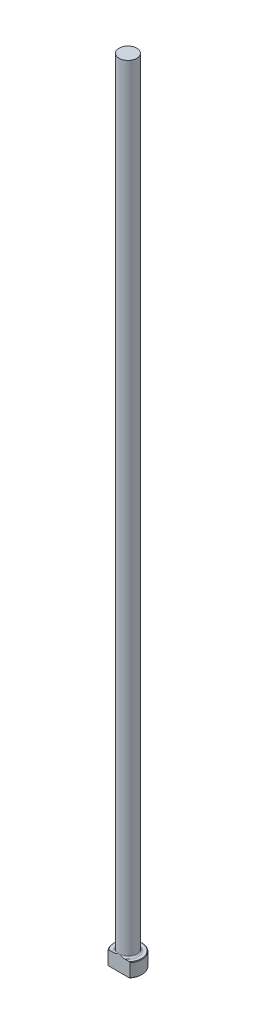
ISO-10303-21;
HEADER;
FILE_DESCRIPTION(('STEP AP214'),'2;1');
FILE_NAME('part.step','',(''),(''),'','','');
FILE_SCHEMA(('AUTOMOTIVE_DESIGN { 1 0 10303 214 1 1 1 1 }'));
ENDSEC;
DATA;
#1=APPLICATION_CONTEXT('core data for automotive mechanical design processes');
#2=APPLICATION_PROTOCOL_DEFINITION('international standard','automotive_design',2000,#1);
#3=PRODUCT_CONTEXT('',#1,'mechanical');
#4=PRODUCT('Part','Part','',(#3));
#5=PRODUCT_RELATED_PRODUCT_CATEGORY('part','',(#4));
#6=PRODUCT_DEFINITION_FORMATION('','',#4);
#7=PRODUCT_DEFINITION_CONTEXT('part definition',#1,'design');
#8=PRODUCT_DEFINITION('design','',#6,#7);
#9=PRODUCT_DEFINITION_SHAPE('','',#8);
#10=(LENGTH_UNIT() NAMED_UNIT(*) SI_UNIT(.MILLI.,.METRE.));
#11=(NAMED_UNIT(*) PLANE_ANGLE_UNIT() SI_UNIT($,.RADIAN.));
#12=(NAMED_UNIT(*) SI_UNIT($,.STERADIAN.) SOLID_ANGLE_UNIT());
#13=UNCERTAINTY_MEASURE_WITH_UNIT(LENGTH_MEASURE(1.E-05),#10,'distance_accuracy_value','');
#14=(GEOMETRIC_REPRESENTATION_CONTEXT(3) GLOBAL_UNCERTAINTY_ASSIGNED_CONTEXT((#13)) GLOBAL_UNIT_ASSIGNED_CONTEXT((#10,
#11,#12)) REPRESENTATION_CONTEXT('',''));
#15=CARTESIAN_POINT('',(0.,0.,0.));
#16=DIRECTION('',(0.,0.,1.));
#17=DIRECTION('',(1.,0.,0.));
#18=AXIS2_PLACEMENT_3D('',#15,#16,#17);
#19=CARTESIAN_POINT('',(0.,0.,0.));
#20=DIRECTION('',(0.,-1.,0.));
#21=DIRECTION('',(0.,0.,-1.));
#22=AXIS2_PLACEMENT_3D('',#19,#20,#21);
#23=PLANE('',#22);
#24=CARTESIAN_POINT('',(0.,0.,0.));
#25=DIRECTION('',(0.,-1.,0.));
#26=DIRECTION('',(0.,0.,-1.));
#27=AXIS2_PLACEMENT_3D('',#24,#25,#26);
#28=CIRCLE('',#27,6.09599999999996);
#29=CARTESIAN_POINT('',(-4.62711999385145,0.,3.96874999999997));
#30=VERTEX_POINT('',#29);
#31=CARTESIAN_POINT('',(4.62711999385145,0.,3.96874999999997));
#32=VERTEX_POINT('',#31);
#33=EDGE_CURVE('E98',#30,#32,#28,.T.);
#34=ORIENTED_EDGE('',*,*,#33,.T.);
#35=DIRECTION('',(-1.,0.,0.));
#36=VECTOR('',#35,1.);
#37=CARTESIAN_POINT('',(-4.95696716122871,0.,3.96874999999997));
#38=LINE('',#37,#36);
#39=EDGE_CURVE('E83',#32,#30,#38,.T.);
#40=ORIENTED_EDGE('',*,*,#39,.T.);
#41=EDGE_LOOP('',(#34,#40));
#42=FACE_BOUND('',#41,.T.);
#43=ADVANCED_FACE('F32',(#42),#23,.T.);
#44=CARTESIAN_POINT('',(0.,259.958771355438,0.));
#45=DIRECTION('',(0.,1.,0.));
#46=DIRECTION('',(0.,0.,1.));
#47=AXIS2_PLACEMENT_3D('',#44,#45,#46);
#48=CYLINDRICAL_SURFACE('',#47,6.34999999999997);
#49=CARTESIAN_POINT('',(0.,6.0960000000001,0.));
#50=DIRECTION('',(0.,1.,0.));
#51=DIRECTION('',(0.,0.,1.));
#52=AXIS2_PLACEMENT_3D('',#49,#50,#51);
#53=CIRCLE('',#52,6.34999999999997);
#54=CARTESIAN_POINT('',(-4.95696716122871,6.0960000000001,3.96874999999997));
#55=VERTEX_POINT('',#54);
#56=CARTESIAN_POINT('',(4.95696716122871,6.0960000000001,3.96874999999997));
#57=VERTEX_POINT('',#56);
#58=EDGE_CURVE('E104',#55,#57,#53,.F.);
#59=ORIENTED_EDGE('',*,*,#58,.T.);
#60=DIRECTION('',(0.,-1.,0.));
#61=VECTOR('',#60,1.);
#62=CARTESIAN_POINT('',(4.95696716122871,355.6,3.96874999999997));
#63=LINE('',#62,#61);
#64=CARTESIAN_POINT('',(4.95696716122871,0.254000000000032,3.96874999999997));
#65=VERTEX_POINT('',#64);
#66=EDGE_CURVE('E183',#57,#65,#63,.T.);
#67=ORIENTED_EDGE('',*,*,#66,.T.);
#68=CARTESIAN_POINT('',(0.,0.254000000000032,0.));
#69=DIRECTION('',(0.,-1.,0.));
#70=DIRECTION('',(0.,0.,-1.));
#71=AXIS2_PLACEMENT_3D('',#68,#69,#70);
#72=CIRCLE('',#71,6.34999999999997);
#73=CARTESIAN_POINT('',(-4.95696716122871,0.254000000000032,3.96874999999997));
#74=VERTEX_POINT('',#73);
#75=EDGE_CURVE('E100',#65,#74,#72,.F.);
#76=ORIENTED_EDGE('',*,*,#75,.T.);
#77=DIRECTION('',(0.,-1.,0.));
#78=VECTOR('',#77,1.);
#79=CARTESIAN_POINT('',(-4.95696716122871,355.6,3.96874999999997));
#80=LINE('',#79,#78);
#81=EDGE_CURVE('E93',#55,#74,#80,.T.);
#82=ORIENTED_EDGE('',*,*,#81,.F.);
#83=EDGE_LOOP('',(#59,#67,#76,#82));
#84=FACE_BOUND('',#83,.T.);
#85=ADVANCED_FACE('F158',(#84),#48,.T.);
#86=CARTESIAN_POINT('',(-6.34999999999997,6.35,0.));
#87=DIRECTION('',(0.,1.,0.));
#88=DIRECTION('',(0.,0.,1.));
#89=AXIS2_PLACEMENT_3D('',#86,#87,#88);
#90=PLANE('',#89);
#91=CARTESIAN_POINT('',(0.,6.35,0.));
#92=DIRECTION('',(0.,1.,0.));
#93=DIRECTION('',(0.,0.,1.));
#94=AXIS2_PLACEMENT_3D('',#91,#92,#93);
#95=CIRCLE('',#94,6.09600000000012);
#96=CARTESIAN_POINT('',(4.62711999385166,6.35,3.96874999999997));
#97=VERTEX_POINT('',#96);
#98=CARTESIAN_POINT('',(-4.62711999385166,6.35,3.96874999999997));
#99=VERTEX_POINT('',#98);
#100=EDGE_CURVE('E178',#97,#99,#95,.T.);
#101=ORIENTED_EDGE('',*,*,#100,.T.);
#102=DIRECTION('',(1.,0.,0.));
#103=VECTOR('',#102,1.);
#104=CARTESIAN_POINT('',(-6.34999999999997,6.35,3.96874999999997));
#105=LINE('',#104,#103);
#106=CARTESIAN_POINT('',(-2.57468813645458,6.35000000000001,3.96874999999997));
#107=VERTEX_POINT('',#106);
#108=EDGE_CURVE('E57',#99,#107,#105,.T.);
#109=ORIENTED_EDGE('',*,*,#108,.T.);
#110=CARTESIAN_POINT('',(0.,6.35,0.));
#111=DIRECTION('',(0.,1.,0.));
#112=DIRECTION('',(0.,0.,1.));
#113=AXIS2_PLACEMENT_3D('',#110,#111,#112);
#114=CIRCLE('',#113,4.73074999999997);
#115=CARTESIAN_POINT('',(2.57468813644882,6.35000000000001,3.96874999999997));
#116=VERTEX_POINT('',#115);
#117=EDGE_CURVE('E107',#107,#116,#114,.F.);
#118=ORIENTED_EDGE('',*,*,#117,.T.);
#119=EDGE_CURVE('E136',#116,#97,#105,.T.);
#120=ORIENTED_EDGE('',*,*,#119,.T.);
#121=EDGE_LOOP('',(#101,#109,#118,#120));
#122=FACE_BOUND('',#121,.T.);
#123=ADVANCED_FACE('F147',(#122),#90,.T.);
#124=CARTESIAN_POINT('',(0.,6.35000000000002,0.));
#125=DIRECTION('',(0.,-1.,0.));
#126=DIRECTION('',(0.,0.,-1.));
#127=AXIS2_PLACEMENT_3D('',#124,#125,#126);
#128=CONICAL_SURFACE('',#127,6.0960000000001,0.785398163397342);
#129=ORIENTED_EDGE('',*,*,#58,.F.);
#130=CARTESIAN_POINT('',(-10.9074797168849,0.838929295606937,3.96874999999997));
#131=CARTESIAN_POINT('',(-10.7362098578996,0.999873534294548,3.96874999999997));
#132=CARTESIAN_POINT('',(-10.5647219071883,1.16058556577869,3.96874999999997));
#133=CARTESIAN_POINT('',(-10.2212389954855,1.48146888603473,3.96874999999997));
#134=CARTESIAN_POINT('',(-10.0492440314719,1.64164017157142,3.96874999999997));
#135=CARTESIAN_POINT('',(-9.53215723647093,2.12144657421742,3.96874999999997));
#136=CARTESIAN_POINT('',(-9.18620012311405,2.44015148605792,3.96874999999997));
#137=CARTESIAN_POINT('',(-8.48250908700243,3.08209947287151,3.96874999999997));
#138=CARTESIAN_POINT('',(-8.12469692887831,3.40525689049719,3.96874999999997));
#139=CARTESIAN_POINT('',(-7.40476794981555,4.04632494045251,3.96874999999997));
#140=CARTESIAN_POINT('',(-7.04265387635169,4.36423864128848,3.96874999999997));
#141=CARTESIAN_POINT('',(-6.49464785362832,4.83529502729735,3.96874999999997));
#142=CARTESIAN_POINT('',(-6.31122194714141,4.99130476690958,3.96874999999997));
#143=CARTESIAN_POINT('',(-5.94233504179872,5.30091560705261,3.96874999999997));
#144=CARTESIAN_POINT('',(-5.75687398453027,5.45451663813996,3.96874999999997));
#145=CARTESIAN_POINT('',(-5.38307682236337,5.75894505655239,3.96874999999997));
#146=CARTESIAN_POINT('',(-5.19473578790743,5.90976640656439,3.96874999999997));
#147=CARTESIAN_POINT('',(-4.81490900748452,6.20737957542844,3.96874999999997));
#148=CARTESIAN_POINT('',(-4.6234235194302,6.35417172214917,3.96874999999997));
#149=CARTESIAN_POINT('',(-4.23840402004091,6.64094245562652,3.96874999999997));
#150=CARTESIAN_POINT('',(-4.04491037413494,6.78097497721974,3.96874999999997));
#151=CARTESIAN_POINT('',(-3.65282433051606,7.05394467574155,3.96874999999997));
#152=CARTESIAN_POINT('',(-3.45422994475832,7.18687902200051,3.96874999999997));
#153=CARTESIAN_POINT('',(-3.0513063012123,7.44227984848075,3.96874999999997));
#154=CARTESIAN_POINT('',(-2.84699866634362,7.56478015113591,3.96874999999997));
#155=CARTESIAN_POINT('',(-2.43048905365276,7.79538986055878,3.96874999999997));
#156=CARTESIAN_POINT('',(-2.21829552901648,7.9035141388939,3.96874999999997));
#157=CARTESIAN_POINT('',(-1.88022874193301,8.05571524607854,3.96874999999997));
#158=CARTESIAN_POINT('',(-1.75760714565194,8.10699294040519,3.96874999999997));
#159=CARTESIAN_POINT('',(-1.50924598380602,8.20152084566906,3.96874999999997));
#160=CARTESIAN_POINT('',(-1.38350591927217,8.24476976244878,3.96874999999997));
#161=CARTESIAN_POINT('',(-1.12977963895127,8.3213362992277,3.96874999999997));
#162=CARTESIAN_POINT('',(-1.0018102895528,8.35470906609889,3.96874999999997));
#163=CARTESIAN_POINT('',(-0.743427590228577,8.410190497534,3.96874999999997));
#164=CARTESIAN_POINT('',(-0.613014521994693,8.43230045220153,3.96874999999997));
#165=CARTESIAN_POINT('',(-0.348820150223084,8.46413643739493,3.96874999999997));
#166=CARTESIAN_POINT('',(-0.215017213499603,8.47368667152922,3.96874999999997));
#167=CARTESIAN_POINT('',(0.0528592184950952,8.47915710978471,3.96874999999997));
#168=CARTESIAN_POINT('',(0.186932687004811,8.4750786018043,3.96874999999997));
#169=CARTESIAN_POINT('',(0.454438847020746,8.45355129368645,3.96874999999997));
#170=CARTESIAN_POINT('',(0.587867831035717,8.43605726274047,3.96874999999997));
#171=CARTESIAN_POINT('',(0.852531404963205,8.38880841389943,3.96874999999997));
#172=CARTESIAN_POINT('',(0.983765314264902,8.35904986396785,3.96874999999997));
#173=CARTESIAN_POINT('',(1.28880023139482,8.27664707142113,3.96874999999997));
#174=CARTESIAN_POINT('',(1.4614132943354,8.21963783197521,3.96874999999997));
#175=CARTESIAN_POINT('',(1.8009000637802,8.09060275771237,3.96874999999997));
#176=CARTESIAN_POINT('',(1.96777052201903,8.01856858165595,3.96874999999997));
#177=CARTESIAN_POINT('',(2.21492486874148,7.90160331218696,3.96874999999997));
#178=CARTESIAN_POINT('',(2.29724213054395,7.86087235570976,3.96874999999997));
#179=CARTESIAN_POINT('',(2.46058693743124,7.77689381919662,3.96874999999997));
#180=CARTESIAN_POINT('',(2.54161446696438,7.73364620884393,3.96874999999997));
#181=CARTESIAN_POINT('',(2.70243717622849,7.64499560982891,3.96874999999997));
#182=CARTESIAN_POINT('',(2.78223280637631,7.59959343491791,3.96874999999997));
#183=CARTESIAN_POINT('',(2.94071403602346,7.50690571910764,3.96874999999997));
#184=CARTESIAN_POINT('',(3.01939969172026,7.45962027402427,3.96874999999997));
#185=CARTESIAN_POINT('',(3.28991241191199,7.2931914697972,3.96874999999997));
#186=CARTESIAN_POINT('',(3.47920753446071,7.16992469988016,3.96874999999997));
#187=CARTESIAN_POINT('',(3.85299575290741,6.91628466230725,3.96874999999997));
#188=CARTESIAN_POINT('',(4.03748740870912,6.78590929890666,3.96874999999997));
#189=CARTESIAN_POINT('',(4.40281517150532,6.51977921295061,3.96874999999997));
#190=CARTESIAN_POINT('',(4.58364746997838,6.38401928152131,3.96874999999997));
#191=CARTESIAN_POINT('',(4.94222498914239,6.10853910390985,3.96874999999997));
#192=CARTESIAN_POINT('',(5.11997054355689,5.96881929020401,3.96874999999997));
#193=CARTESIAN_POINT('',(5.47373559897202,5.68571433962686,3.96874999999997));
#194=CARTESIAN_POINT('',(5.64974474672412,5.54231629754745,3.96874999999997));
#195=CARTESIAN_POINT('',(5.99974206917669,5.25307243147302,3.96874999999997));
#196=CARTESIAN_POINT('',(6.1737301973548,5.10722655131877,3.96874999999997));
#197=CARTESIAN_POINT('',(6.69302814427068,4.66694445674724,3.96874999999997));
#198=CARTESIAN_POINT('',(7.03587209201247,4.36960132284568,3.96874999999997));
#199=CARTESIAN_POINT('',(7.67698172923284,3.80499574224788,3.96874999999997));
#200=CARTESIAN_POINT('',(7.97575257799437,3.53830334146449,3.96874999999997));
#201=CARTESIAN_POINT('',(8.57066794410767,3.0019136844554,3.96874999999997));
#202=CARTESIAN_POINT('',(8.86681204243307,2.73221596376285,3.96874999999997));
#203=CARTESIAN_POINT('',(9.45462121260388,2.1928407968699,3.96874999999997));
#204=CARTESIAN_POINT('',(9.74630307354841,1.92318161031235,3.96874999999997));
#205=CARTESIAN_POINT('',(10.3280138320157,1.3821997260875,3.96874999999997));
#206=CARTESIAN_POINT('',(10.6180430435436,1.11087736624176,3.96874999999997));
#207=CARTESIAN_POINT('',(10.9074797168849,0.838929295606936,3.96874999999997));
#208=B_SPLINE_CURVE_WITH_KNOTS('',3,(#130,#131,#132,#133,#134,#135,#136,#137,#138,#139,#140,
#141,#142,#143,#144,#145,#146,#147,#148,#149,#150,#151,#152,#153,#154,#155,#156,#157,#158,#159,
#160,#161,#162,#163,#164,#165,#166,#167,#168,#169,#170,#171,#172,#173,#174,#175,#176,#177,#178,
#179,#180,#181,#182,#183,#184,#185,#186,#187,#188,#189,#190,#191,#192,#193,#194,#195,#196,#197,
#198,#199,#200,#201,#202,#203,#204,#205,#206,#207),.UNSPECIFIED.,.F.,.F.,(4,2,2,2,2,2,2,2,2,2,2,
2,2,2,2,2,2,2,2,2,2,2,2,2,2,2,2,2,2,2,2,2,2,2,2,2,2,2,4),(0.,0.705072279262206,1.41014876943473,
2.82127665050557,4.26767292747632,5.71319041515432,6.43557153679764,7.15797344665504,
7.88179359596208,8.60555467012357,9.32198841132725,10.0387057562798,10.753003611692,
11.4665567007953,11.8650702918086,12.2636480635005,12.6599563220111,13.0562191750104,
13.457971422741,13.859685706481,14.2627603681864,14.665957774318,15.2103582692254,
15.7550618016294,16.0305566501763,16.3060548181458,16.5814497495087,16.856830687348,
17.5342490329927,18.2118681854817,18.8901596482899,19.5683773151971,20.2494368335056,
20.930511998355,22.2918881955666,23.4933255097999,24.6949511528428,25.8866442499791,
27.0781028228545),.UNSPECIFIED.);
#209=EDGE_CURVE('E135',#55,#99,#208,.T.);
#210=ORIENTED_EDGE('',*,*,#209,.T.);
#211=ORIENTED_EDGE('',*,*,#100,.F.);
#212=EDGE_CURVE('E127',#97,#57,#208,.T.);
#213=ORIENTED_EDGE('',*,*,#212,.T.);
#214=EDGE_LOOP('',(#129,#210,#211,#213));
#215=FACE_BOUND('',#214,.T.);
#216=ADVANCED_FACE('F143',(#215),#128,.T.);
#217=CARTESIAN_POINT('',(0.,0.254000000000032,0.));
#218=DIRECTION('',(0.,1.,0.));
#219=DIRECTION('',(0.,0.,1.));
#220=AXIS2_PLACEMENT_3D('',#217,#218,#219);
#221=CONICAL_SURFACE('',#220,6.34999999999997,0.785398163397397);
#222=ORIENTED_EDGE('',*,*,#75,.F.);
#223=CARTESIAN_POINT('',(10.9074797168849,5.51107070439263,3.96874999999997));
#224=CARTESIAN_POINT('',(10.7362098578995,5.35012646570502,3.96874999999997));
#225=CARTESIAN_POINT('',(10.5647219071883,5.18941443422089,3.96874999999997));
#226=CARTESIAN_POINT('',(10.2212389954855,4.86853111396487,3.96874999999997));
#227=CARTESIAN_POINT('',(10.0492440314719,4.7083598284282,3.96874999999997));
#228=CARTESIAN_POINT('',(9.53215723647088,4.22855342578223,3.96874999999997));
#229=CARTESIAN_POINT('',(9.18620012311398,3.90984851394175,3.96874999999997));
#230=CARTESIAN_POINT('',(8.48250908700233,3.26790052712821,3.96874999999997));
#231=CARTESIAN_POINT('',(8.12469692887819,2.94474310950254,3.96874999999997));
#232=CARTESIAN_POINT('',(7.4047679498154,2.30367505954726,3.96874999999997));
#233=CARTESIAN_POINT('',(7.04265387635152,1.98576135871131,3.96874999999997));
#234=CARTESIAN_POINT('',(6.49464785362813,1.51470497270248,3.96874999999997));
#235=CARTESIAN_POINT('',(6.3112219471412,1.35869523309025,3.96874999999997));
#236=CARTESIAN_POINT('',(5.94233504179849,1.04908439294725,3.96874999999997));
#237=CARTESIAN_POINT('',(5.75687398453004,0.895483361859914,3.96874999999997));
#238=CARTESIAN_POINT('',(5.38307682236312,0.591054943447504,3.96874999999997));
#239=CARTESIAN_POINT('',(5.19473578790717,0.44023359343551,3.96874999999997));
#240=CARTESIAN_POINT('',(4.81490900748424,0.142620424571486,3.96874999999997));
#241=CARTESIAN_POINT('',(4.62342351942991,-0.00417172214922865,3.96874999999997));
#242=CARTESIAN_POINT('',(4.2384040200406,-0.290942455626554,3.96874999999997));
#243=CARTESIAN_POINT('',(4.04491037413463,-0.430974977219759,3.96874999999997));
#244=CARTESIAN_POINT('',(3.65282433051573,-0.703944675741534,3.96874999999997));
#245=CARTESIAN_POINT('',(3.45422994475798,-0.836879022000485,3.96874999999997));
#246=CARTESIAN_POINT('',(3.05130630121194,-1.09227984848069,3.96874999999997));
#247=CARTESIAN_POINT('',(2.84699866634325,-1.21478015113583,3.96874999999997));
#248=CARTESIAN_POINT('',(2.43048905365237,-1.44538986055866,3.96874999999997));
#249=CARTESIAN_POINT('',(2.21829552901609,-1.55351413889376,3.96874999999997));
#250=CARTESIAN_POINT('',(1.8802287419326,-1.70571524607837,3.96874999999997));
#251=CARTESIAN_POINT('',(1.75760714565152,-1.756992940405,3.96874999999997));
#252=CARTESIAN_POINT('',(1.50924598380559,-1.85152084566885,3.96874999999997));
#253=CARTESIAN_POINT('',(1.38350591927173,-1.89476976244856,3.96874999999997));
#254=CARTESIAN_POINT('',(1.12977963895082,-1.97133629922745,3.96874999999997));
#255=CARTESIAN_POINT('',(1.00181028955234,-2.00470906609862,3.96874999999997));
#256=CARTESIAN_POINT('',(0.74342759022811,-2.0601904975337,3.96874999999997));
#257=CARTESIAN_POINT('',(0.613014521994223,-2.08230045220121,3.96874999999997));
#258=CARTESIAN_POINT('',(0.348820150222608,-2.11413643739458,3.96874999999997));
#259=CARTESIAN_POINT('',(0.215017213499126,-2.12368667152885,3.96874999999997));
#260=CARTESIAN_POINT('',(-0.0528592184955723,-2.12915710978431,3.96874999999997));
#261=CARTESIAN_POINT('',(-0.186932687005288,-2.12507860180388,3.96874999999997));
#262=CARTESIAN_POINT('',(-0.454438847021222,-2.10355129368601,3.96874999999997));
#263=CARTESIAN_POINT('',(-0.587867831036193,-2.08605726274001,3.96874999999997));
#264=CARTESIAN_POINT('',(-0.852531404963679,-2.03880841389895,3.96874999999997));
#265=CARTESIAN_POINT('',(-0.983765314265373,-2.00904986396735,3.96874999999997));
#266=CARTESIAN_POINT('',(-1.28880023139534,-1.9266470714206,3.96874999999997));
#267=CARTESIAN_POINT('',(-1.46141329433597,-1.86963783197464,3.96874999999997));
#268=CARTESIAN_POINT('',(-1.80090006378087,-1.74060275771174,3.96874999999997));
#269=CARTESIAN_POINT('',(-1.96777052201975,-1.66856858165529,3.96874999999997));
#270=CARTESIAN_POINT('',(-2.21492486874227,-1.55160331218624,3.96874999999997));
#271=CARTESIAN_POINT('',(-2.29724213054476,-1.51087235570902,3.96874999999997));
#272=CARTESIAN_POINT('',(-2.4605869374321,-1.42689381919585,3.96874999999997));
#273=CARTESIAN_POINT('',(-2.54161446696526,-1.38364620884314,3.96874999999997));
#274=CARTESIAN_POINT('',(-2.70243717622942,-1.29499560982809,3.96874999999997));
#275=CARTESIAN_POINT('',(-2.78223280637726,-1.24959343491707,3.96874999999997));
#276=CARTESIAN_POINT('',(-2.94071403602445,-1.15690571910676,3.96874999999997));
#277=CARTESIAN_POINT('',(-3.01939969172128,-1.10962027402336,3.96874999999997));
#278=CARTESIAN_POINT('',(-3.28991241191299,-0.94319146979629,3.96874999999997));
#279=CARTESIAN_POINT('',(-3.47920753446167,-0.819924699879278,3.96874999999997));
#280=CARTESIAN_POINT('',(-3.85299575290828,-0.566284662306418,3.96874999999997));
#281=CARTESIAN_POINT('',(-4.03748740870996,-0.435909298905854,3.96874999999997));
#282=CARTESIAN_POINT('',(-4.40281517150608,-0.169779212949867,3.96874999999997));
#283=CARTESIAN_POINT('',(-4.5836474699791,-0.0340192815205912,3.96874999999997));
#284=CARTESIAN_POINT('',(-4.94222498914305,0.241460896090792,3.96874999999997));
#285=CARTESIAN_POINT('',(-5.11997054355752,0.381180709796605,3.96874999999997));
#286=CARTESIAN_POINT('',(-5.47373559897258,0.664285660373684,3.96874999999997));
#287=CARTESIAN_POINT('',(-5.64974474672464,0.807683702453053,3.96874999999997));
#288=CARTESIAN_POINT('',(-5.99974206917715,1.09692756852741,3.96874999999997));
#289=CARTESIAN_POINT('',(-6.17373019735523,1.24277344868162,3.96874999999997));
#290=CARTESIAN_POINT('',(-6.69302814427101,1.68305554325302,3.96874999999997));
#291=CARTESIAN_POINT('',(-7.03587209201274,1.9803986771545,3.96874999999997));
#292=CARTESIAN_POINT('',(-7.67698172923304,2.54500425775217,3.96874999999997));
#293=CARTESIAN_POINT('',(-7.97575257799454,2.81169665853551,3.96874999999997));
#294=CARTESIAN_POINT('',(-8.57066794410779,3.34808631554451,3.96874999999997));
#295=CARTESIAN_POINT('',(-8.86681204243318,3.61778403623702,3.96874999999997));
#296=CARTESIAN_POINT('',(-9.45462121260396,4.15715920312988,3.96874999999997));
#297=CARTESIAN_POINT('',(-9.74630307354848,4.42681838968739,3.96874999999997));
#298=CARTESIAN_POINT('',(-10.3280138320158,4.96780027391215,3.96874999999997));
#299=CARTESIAN_POINT('',(-10.6180430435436,5.23912263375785,3.96874999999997));
#300=CARTESIAN_POINT('',(-10.9074797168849,5.51107070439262,3.96874999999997));
#301=B_SPLINE_CURVE_WITH_KNOTS('',3,(#223,#224,#225,#226,#227,#228,#229,#230,#231,#232,#233,
#234,#235,#236,#237,#238,#239,#240,#241,#242,#243,#244,#245,#246,#247,#248,#249,#250,#251,#252,
#253,#254,#255,#256,#257,#258,#259,#260,#261,#262,#263,#264,#265,#266,#267,#268,#269,#270,#271,
#272,#273,#274,#275,#276,#277,#278,#279,#280,#281,#282,#283,#284,#285,#286,#287,#288,#289,#290,
#291,#292,#293,#294,#295,#296,#297,#298,#299,#300),.UNSPECIFIED.,.F.,.F.,(4,2,2,2,2,2,2,2,2,2,2,
2,2,2,2,2,2,2,2,2,2,2,2,2,2,2,2,2,2,2,2,2,2,2,2,2,2,2,4),(0.,0.7050722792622,1.41014876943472,
2.82127665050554,4.26767292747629,5.71319041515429,6.43557153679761,7.15797344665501,
7.88179359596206,8.60555467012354,9.32198841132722,10.0387057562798,10.7530036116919,
11.4665567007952,11.8650702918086,12.2636480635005,12.6599563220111,13.0562191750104,
13.457971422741,13.8596857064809,14.2627603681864,14.6659577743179,15.2103582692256,
15.7550618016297,16.0305566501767,16.3060548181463,16.5814497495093,16.8568306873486,
17.5342490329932,18.2118681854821,18.8901596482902,19.5683773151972,20.2494368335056,
20.9305119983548,22.2918881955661,23.4933255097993,24.6949511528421,25.8866442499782,
27.0781028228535),.UNSPECIFIED.);
#302=EDGE_CURVE('E86',#65,#32,#301,.T.);
#303=ORIENTED_EDGE('',*,*,#302,.T.);
#304=ORIENTED_EDGE('',*,*,#33,.F.);
#305=EDGE_CURVE('E89',#30,#74,#301,.T.);
#306=ORIENTED_EDGE('',*,*,#305,.T.);
#307=EDGE_LOOP('',(#222,#303,#304,#306));
#308=FACE_BOUND('',#307,.T.);
#309=ADVANCED_FACE('F97',(#308),#221,.T.);
#310=CARTESIAN_POINT('',(0.,7.11200000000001,0.));
#311=DIRECTION('',(0.,1.,0.));
#312=DIRECTION('',(0.,0.,1.));
#313=AXIS2_PLACEMENT_3D('',#310,#311,#312);
#314=TOROIDAL_SURFACE('',#313,4.73074999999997,0.762);
#315=CARTESIAN_POINT('',(0.,7.11200000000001,3.96874999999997));
#316=CARTESIAN_POINT('',(2.72452874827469E-10,7.11200100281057,3.96874999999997));
#317=CARTESIAN_POINT('',(1.89097572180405E-07,7.11200200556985,3.96874999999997));
#318=CARTESIAN_POINT('',(7.99901127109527E-07,7.11200394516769,3.96874999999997));
#319=CARTESIAN_POINT('',(1.2266662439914E-06,7.11200488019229,3.96874999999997));
#320=CARTESIAN_POINT('',(2.25601477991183E-06,7.11200673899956,3.96874999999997));
#321=CARTESIAN_POINT('',(2.86938873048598E-06,7.11200765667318,3.96874999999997));
#322=CARTESIAN_POINT('',(4.2009410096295E-06,7.11200939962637,3.96874999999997));
#323=CARTESIAN_POINT('',(4.91843246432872E-06,7.11201022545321,3.96874999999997));
#324=CARTESIAN_POINT('',(7.4625804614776E-06,7.11201295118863,3.96874999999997));
#325=CARTESIAN_POINT('',(9.42693843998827E-06,7.11201472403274,3.96874999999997));
#326=CARTESIAN_POINT('',(1.35156238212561E-05,7.11201792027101,3.96874999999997));
#327=CARTESIAN_POINT('',(1.56334419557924E-05,7.11201935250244,3.96874999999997));
#328=CARTESIAN_POINT('',(2.37794366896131E-05,7.11202462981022,3.96874999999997));
#329=CARTESIAN_POINT('',(3.00000425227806E-05,7.11202818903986,3.96874999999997));
#330=CARTESIAN_POINT('',(4.23604379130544E-05,7.11203410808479,3.96874999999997));
#331=CARTESIAN_POINT('',(4.84662901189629E-05,7.11203654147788,3.96874999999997));
#332=CARTESIAN_POINT('',(7.41361994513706E-05,7.11204669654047,3.96874999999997));
#333=CARTESIAN_POINT('',(9.37464432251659E-05,7.11205427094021,3.96874999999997));
#334=CARTESIAN_POINT('',(0.000130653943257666,7.11206661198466,3.96874999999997));
#335=CARTESIAN_POINT('',(0.00014786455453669,7.11207162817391,3.96874999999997));
#336=CARTESIAN_POINT('',(0.000271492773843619,7.11211085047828,3.96874999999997));
#337=CARTESIAN_POINT('',(0.000372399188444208,7.11216017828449,3.96874999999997));
#338=CARTESIAN_POINT('',(0.000762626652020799,7.11234384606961,3.96874999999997));
#339=CARTESIAN_POINT('',(0.00105578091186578,7.1124669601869,3.96874999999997));
#340=CARTESIAN_POINT('',(0.00218658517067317,7.11294905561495,3.96874999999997));
#341=CARTESIAN_POINT('',(0.00302029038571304,7.11331980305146,3.96874999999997));
#342=CARTESIAN_POINT('',(0.00641326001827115,7.11482126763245,3.96874999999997));
#343=CARTESIAN_POINT('',(0.00897690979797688,7.1159386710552,3.96874999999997));
#344=CARTESIAN_POINT('',(0.0431521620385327,7.13084393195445,3.96874999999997));
#345=CARTESIAN_POINT('',(0.0747329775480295,7.14472589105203,3.96874999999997));
#346=CARTESIAN_POINT('',(0.138371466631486,7.17259981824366,3.96874999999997));
#347=CARTESIAN_POINT('',(0.170429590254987,7.18659058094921,3.96874999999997));
#348=CARTESIAN_POINT('',(0.263897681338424,7.22728018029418,3.96874999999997));
#349=CARTESIAN_POINT('',(0.32534291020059,7.25390148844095,3.96874999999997));
#350=CARTESIAN_POINT('',(0.45545149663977,7.30966012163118,3.96874999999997));
#351=CARTESIAN_POINT('',(0.524140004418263,7.33873873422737,3.96874999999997));
#352=CARTESIAN_POINT('',(0.662588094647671,7.39626071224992,3.96874999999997));
#353=CARTESIAN_POINT('',(0.732351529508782,7.42469485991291,3.96874999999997));
#354=CARTESIAN_POINT('',(0.854677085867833,7.47322946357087,3.96874999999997));
#355=CARTESIAN_POINT('',(0.907124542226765,7.49361793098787,3.96874999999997));
#356=CARTESIAN_POINT('',(1.01222990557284,7.53345950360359,3.96874999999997));
#357=CARTESIAN_POINT('',(1.06488701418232,7.55291472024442,3.96874999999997));
#358=CARTESIAN_POINT('',(1.22118224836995,7.60890100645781,3.96874999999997));
#359=CARTESIAN_POINT('',(1.32536392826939,7.64394780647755,3.96874999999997));
#360=CARTESIAN_POINT('',(1.51475689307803,7.70222633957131,3.96874999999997));
#361=CARTESIAN_POINT('',(1.59966831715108,7.72642606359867,3.96874999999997));
#362=CARTESIAN_POINT('',(1.77115576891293,7.77055798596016,3.96874999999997));
#363=CARTESIAN_POINT('',(1.85773874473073,7.79046358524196,3.96874999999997));
#364=CARTESIAN_POINT('',(2.03663433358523,7.8256694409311,3.96874999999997));
#365=CARTESIAN_POINT('',(2.12900742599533,7.84066973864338,3.96874999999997));
#366=CARTESIAN_POINT('',(2.31450882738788,7.86300878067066,3.96874999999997));
#367=CARTESIAN_POINT('',(2.40763490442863,7.87036510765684,3.96874999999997));
#368=CARTESIAN_POINT('',(2.58622461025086,7.87533872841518,3.96874999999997));
#369=CARTESIAN_POINT('',(2.67166229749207,7.87373524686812,3.96874999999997));
#370=CARTESIAN_POINT('',(2.84116133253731,7.86073590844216,3.96874999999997));
#371=CARTESIAN_POINT('',(2.92522821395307,7.84942227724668,3.96874999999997));
#372=CARTESIAN_POINT('',(3.09260159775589,7.81445437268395,3.96874999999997));
#373=CARTESIAN_POINT('',(3.17586039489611,7.79056108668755,3.96874999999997));
#374=CARTESIAN_POINT('',(3.33637449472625,7.72711703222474,3.96874999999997));
#375=CARTESIAN_POINT('',(3.41365062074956,7.6876237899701,3.96874999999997));
#376=CARTESIAN_POINT('',(3.51798857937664,7.61566535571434,3.96874999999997));
#377=CARTESIAN_POINT('',(3.55006318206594,7.59045187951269,3.96874999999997));
#378=CARTESIAN_POINT('',(3.6102188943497,7.53557765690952,3.96874999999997));
#379=CARTESIAN_POINT('',(3.63830099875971,7.50591802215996,3.96874999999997));
#380=CARTESIAN_POINT('',(3.68933162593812,7.44181271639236,3.96874999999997));
#381=CARTESIAN_POINT('',(3.7122145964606,7.40731395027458,3.96874999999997));
#382=CARTESIAN_POINT('',(3.75063172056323,7.3344255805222,3.96874999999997));
#383=CARTESIAN_POINT('',(3.76617854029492,7.29604282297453,3.96874999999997));
#384=CARTESIAN_POINT('',(3.7867432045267,7.22260269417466,3.96874999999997));
#385=CARTESIAN_POINT('',(3.79297266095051,7.18788564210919,3.96874999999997));
#386=CARTESIAN_POINT('',(3.79840708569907,7.11791009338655,3.96874999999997));
#387=CARTESIAN_POINT('',(3.79761729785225,7.08265202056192,3.96874999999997));
#388=CARTESIAN_POINT('',(3.7897274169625,7.01808169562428,3.96874999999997));
#389=CARTESIAN_POINT('',(3.78356056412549,6.98864967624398,3.96874999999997));
#390=CARTESIAN_POINT('',(3.76657344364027,6.93117296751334,3.96874999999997));
#391=CARTESIAN_POINT('',(3.75575305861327,6.90312831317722,3.96874999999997));
#392=CARTESIAN_POINT('',(3.72949416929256,6.84779976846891,3.96874999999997));
#393=CARTESIAN_POINT('',(3.713874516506,6.82060268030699,3.96874999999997));
#394=CARTESIAN_POINT('',(3.67898159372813,6.76868386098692,3.96874999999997));
#395=CARTESIAN_POINT('',(3.6597066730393,6.74396325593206,3.96874999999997));
#396=CARTESIAN_POINT('',(3.60698815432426,6.68446341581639,3.96874999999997));
#397=CARTESIAN_POINT('',(3.57151931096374,6.65147423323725,3.96874999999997));
#398=CARTESIAN_POINT('',(3.49575447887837,6.59155388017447,3.96874999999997));
#399=CARTESIAN_POINT('',(3.45544429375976,6.56464122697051,3.96874999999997));
#400=CARTESIAN_POINT('',(3.35110964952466,6.50463027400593,3.96874999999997));
#401=CARTESIAN_POINT('',(3.2851315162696,6.47494717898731,3.96874999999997));
#402=CARTESIAN_POINT('',(3.1496628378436,6.42615277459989,3.96874999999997));
#403=CARTESIAN_POINT('',(3.08017671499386,6.40702850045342,3.96874999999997));
#404=CARTESIAN_POINT('',(2.95179922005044,6.38006601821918,3.96874999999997));
#405=CARTESIAN_POINT('',(2.89318763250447,6.37083647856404,3.96874999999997));
#406=CARTESIAN_POINT('',(2.77536712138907,6.35745547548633,3.96874999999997));
#407=CARTESIAN_POINT('',(2.71615776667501,6.35330798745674,3.96874999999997));
#408=CARTESIAN_POINT('',(2.53632384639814,6.34734840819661,3.96874999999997));
#409=CARTESIAN_POINT('',(2.41545754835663,6.35237783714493,3.96874999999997));
#410=CARTESIAN_POINT('',(2.21811250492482,6.3716785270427,3.96874999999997));
#411=CARTESIAN_POINT('',(2.14116511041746,6.38201761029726,3.96874999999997));
#412=CARTESIAN_POINT('',(1.98802972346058,6.40734893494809,3.96874999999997));
#413=CARTESIAN_POINT('',(1.9118417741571,6.42234143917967,3.96874999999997));
#414=CARTESIAN_POINT('',(1.6839709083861,6.47322550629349,3.96874999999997));
#415=CARTESIAN_POINT('',(1.53360062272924,6.5149500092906,3.96874999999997));
#416=CARTESIAN_POINT('',(1.24863432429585,6.60495823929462,3.96874999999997));
#417=CARTESIAN_POINT('',(1.11376371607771,6.65241192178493,3.96874999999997));
#418=CARTESIAN_POINT('',(0.847576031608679,6.75264930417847,3.96874999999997));
#419=CARTESIAN_POINT('',(0.716236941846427,6.80537521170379,3.96874999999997));
#420=CARTESIAN_POINT('',(0.544659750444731,6.87676192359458,3.96874999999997));
#421=CARTESIAN_POINT('',(0.503794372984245,6.89395286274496,3.96874999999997));
#422=CARTESIAN_POINT('',(0.421123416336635,6.92903262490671,3.96874999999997));
#423=CARTESIAN_POINT('',(0.37932061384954,6.94692803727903,3.96874999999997));
#424=CARTESIAN_POINT('',(0.308934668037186,6.97725002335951,3.96874999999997));
#425=CARTESIAN_POINT('',(0.280329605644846,6.98962609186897,3.96874999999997));
#426=CARTESIAN_POINT('',(0.223423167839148,7.0143301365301,3.96874999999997));
#427=CARTESIAN_POINT('',(0.195121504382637,7.02665744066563,3.96874999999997));
#428=CARTESIAN_POINT('',(0.141398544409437,7.05009288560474,3.96874999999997));
#429=CARTESIAN_POINT('',(0.115975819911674,7.06119805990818,3.96874999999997));
#430=CARTESIAN_POINT('',(0.0642235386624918,7.08387460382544,3.96874999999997));
#431=CARTESIAN_POINT('',(0.0378947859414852,7.09544818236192,3.96874999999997));
#432=CARTESIAN_POINT('',(0.00898087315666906,7.1080596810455,3.96874999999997));
#433=CARTESIAN_POINT('',(0.00642114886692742,7.1091753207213,3.96874999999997));
#434=CARTESIAN_POINT('',(0.00302915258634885,7.11067631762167,3.96874999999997));
#435=CARTESIAN_POINT('',(0.00219250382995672,7.11104837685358,3.96874999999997));
#436=CARTESIAN_POINT('',(0.0010579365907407,7.11153207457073,3.96874999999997));
#437=CARTESIAN_POINT('',(0.000763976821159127,7.11165552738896,3.96874999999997));
#438=CARTESIAN_POINT('',(0.000372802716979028,7.11183964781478,3.96874999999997));
#439=CARTESIAN_POINT('',(0.000271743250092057,7.111889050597,3.96874999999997));
#440=CARTESIAN_POINT('',(0.000147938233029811,7.11192831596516,3.96874999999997));
#441=CARTESIAN_POINT('',(0.000130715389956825,7.11193333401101,3.96874999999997));
#442=CARTESIAN_POINT('',(9.3781335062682E-05,7.11194568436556,3.96874999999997));
#443=CARTESIAN_POINT('',(7.41570977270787E-05,7.11195326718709,3.96874999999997));
#444=CARTESIAN_POINT('',(4.84714569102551E-05,7.11196343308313,3.96874999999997));
#445=CARTESIAN_POINT('',(4.23636191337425E-05,7.11196586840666,3.96874999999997));
#446=CARTESIAN_POINT('',(2.99995408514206E-05,7.11197179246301,3.96874999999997));
#447=CARTESIAN_POINT('',(2.37773032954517E-05,7.11197535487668,3.96874999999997));
#448=CARTESIAN_POINT('',(1.5629804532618E-05,7.11198063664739,3.96874999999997));
#449=CARTESIAN_POINT('',(1.3511828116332E-05,7.11198206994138,3.96874999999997));
#450=CARTESIAN_POINT('',(9.42304071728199E-06,7.11198526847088,3.96874999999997));
#451=CARTESIAN_POINT('',(7.45874783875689E-06,7.11198704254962,3.96874999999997));
#452=CARTESIAN_POINT('',(4.91494695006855E-06,7.11198977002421,3.96874999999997));
#453=CARTESIAN_POINT('',(4.19760643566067E-06,7.11199059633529,3.96874999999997));
#454=CARTESIAN_POINT('',(2.86644232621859E-06,7.11199234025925,3.96874999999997));
#455=CARTESIAN_POINT('',(2.25330635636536E-06,7.11199325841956,3.96874999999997));
#456=CARTESIAN_POINT('',(1.22453499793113E-06,7.11199511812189,3.96874999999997));
#457=CARTESIAN_POINT('',(7.98099013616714E-07,7.11199605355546,3.96874999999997));
#458=CARTESIAN_POINT('',(1.88090826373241E-07,7.11199799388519,3.96874999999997));
#459=CARTESIAN_POINT('',(-2.72512968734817E-10,7.11199899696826,3.96874999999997));
#460=CARTESIAN_POINT('',(0.,7.11200000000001,3.96874999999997));
#461=B_SPLINE_CURVE_WITH_KNOTS('',3,(#315,#316,#317,#318,#319,#320,#321,#322,#323,#324,#325,
#326,#327,#328,#329,#330,#331,#332,#333,#334,#335,#336,#337,#338,#339,#340,#341,#342,#343,#344,
#345,#346,#347,#348,#349,#350,#351,#352,#353,#354,#355,#356,#357,#358,#359,#360,#361,#362,#363,
#364,#365,#366,#367,#368,#369,#370,#371,#372,#373,#374,#375,#376,#377,#378,#379,#380,#381,#382,
#383,#384,#385,#386,#387,#388,#389,#390,#391,#392,#393,#394,#395,#396,#397,#398,#399,#400,#401,
#402,#403,#404,#405,#406,#407,#408,#409,#410,#411,#412,#413,#414,#415,#416,#417,#418,#419,#420,
#421,#422,#423,#424,#425,#426,#427,#428,#429,#430,#431,#432,#433,#434,#435,#436,#437,#438,#439,
#440,#441,#442,#443,#444,#445,#446,#447,#448,#449,#450,#451,#452,#453,#454,#455,#456,#457,#458,
#459,#460),.UNSPECIFIED.,.T.,.F.,(4,2,2,2,2,2,2,2,2,2,2,2,2,2,2,2,2,2,2,2,2,2,2,2,2,2,2,2,2,2,2,
2,2,2,2,2,2,2,2,2,2,2,2,2,2,2,2,2,2,2,2,2,2,2,2,2,2,2,2,2,2,2,2,2,2,2,2,2,2,2,2,2,4),(0.,
3.0057780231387E-06,6.07432687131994E-06,9.37314624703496E-06,1.26511167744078E-05,
2.05502244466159E-05,2.82140028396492E-05,4.9640489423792E-05,6.93390753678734E-05,
0.000132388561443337,0.000186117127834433,0.0005216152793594,0.00147666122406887,
0.00421247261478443,0.0126037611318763,0.116083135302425,0.2210203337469,0.42190992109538,
0.645676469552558,0.871672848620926,1.04047829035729,1.20888182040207,1.53851282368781,
1.80329858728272,2.06968019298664,2.3501784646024,2.63003009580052,2.88594405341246,
3.13971207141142,3.39848556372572,3.65631358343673,3.77836256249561,3.90038107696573,
4.02386182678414,4.14712859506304,4.25227920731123,4.35735127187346,4.44716152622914,
4.53697404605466,4.63071137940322,4.72449114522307,4.86898620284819,5.01391581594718,
5.22974914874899,5.44531687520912,5.62306851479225,5.8009591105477,6.16266479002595,
6.3954713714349,6.62829110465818,7.09579230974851,7.52455372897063,7.94904482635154,
8.08204777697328,8.21846301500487,8.31196587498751,8.40457450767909,8.4878041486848,
8.57407464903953,8.58245304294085,8.58519851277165,8.58615618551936,8.58649219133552,
8.5865459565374,8.58660905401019,8.5866287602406,8.58665019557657,8.58665786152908,
8.58666576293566,8.58666904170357,8.58667234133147,8.58667541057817,8.58667841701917),.UNSPECIFIED.);
#462=CARTESIAN_POINT('',(0.,7.11200000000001,3.96874999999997));
#463=VERTEX_POINT('',#462);
#464=EDGE_CURVE('E11',#116,#463,#461,.T.);
#465=ORIENTED_EDGE('',*,*,#464,.F.);
#466=ORIENTED_EDGE('',*,*,#117,.F.);
#467=CARTESIAN_POINT('',(0.,7.11200000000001,3.96874999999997));
#468=CARTESIAN_POINT('',(-2.72452813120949E-10,7.11199899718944,3.96874999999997));
#469=CARTESIAN_POINT('',(-1.89097572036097E-07,7.11199799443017,3.96874999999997));
#470=CARTESIAN_POINT('',(-7.99901127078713E-07,7.11199605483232,3.96874999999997));
#471=CARTESIAN_POINT('',(-1.22666624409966E-06,7.11199511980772,3.96874999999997));
#472=CARTESIAN_POINT('',(-2.25601477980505E-06,7.11199326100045,3.96874999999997));
#473=CARTESIAN_POINT('',(-2.86938873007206E-06,7.11199234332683,3.96874999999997));
#474=CARTESIAN_POINT('',(-4.20094100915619E-06,7.11199060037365,3.96874999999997));
#475=CARTESIAN_POINT('',(-4.91843246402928E-06,7.1119897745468,3.96874999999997));
#476=CARTESIAN_POINT('',(-7.46258046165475E-06,7.11198704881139,3.96874999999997));
#477=CARTESIAN_POINT('',(-9.42693844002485E-06,7.11198527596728,3.96874999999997));
#478=CARTESIAN_POINT('',(-1.35156238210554E-05,7.11198207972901,3.96874999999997));
#479=CARTESIAN_POINT('',(-1.56334419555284E-05,7.11198064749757,3.96874999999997));
#480=CARTESIAN_POINT('',(-2.3779436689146E-05,7.11197537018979,3.96874999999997));
#481=CARTESIAN_POINT('',(-3.00000425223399E-05,7.11197181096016,3.96874999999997));
#482=CARTESIAN_POINT('',(-4.23604379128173E-05,7.11196589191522,3.96874999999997));
#483=CARTESIAN_POINT('',(-4.84662901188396E-05,7.11196345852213,3.96874999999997));
#484=CARTESIAN_POINT('',(-7.41361994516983E-05,7.11195330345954,3.96874999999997));
#485=CARTESIAN_POINT('',(-9.37464432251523E-05,7.11194572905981,3.96874999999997));
#486=CARTESIAN_POINT('',(-0.000130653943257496,7.11193338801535,3.96874999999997));
#487=CARTESIAN_POINT('',(-0.000147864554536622,7.1119283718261,3.96874999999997));
#488=CARTESIAN_POINT('',(-0.00027149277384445,7.11188914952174,3.96874999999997));
#489=CARTESIAN_POINT('',(-0.000372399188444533,7.11183982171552,3.96874999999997));
#490=CARTESIAN_POINT('',(-0.000762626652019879,7.1116561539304,3.96874999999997));
#491=CARTESIAN_POINT('',(-0.00105578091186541,7.11153303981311,3.96874999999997));
#492=CARTESIAN_POINT('',(-0.00218658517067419,7.11105094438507,3.96874999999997));
#493=CARTESIAN_POINT('',(-0.00302029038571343,7.11068019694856,3.96874999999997));
#494=CARTESIAN_POINT('',(-0.00641326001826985,7.10917873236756,3.96874999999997));
#495=CARTESIAN_POINT('',(-0.00897690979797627,7.10806132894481,3.96874999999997));
#496=CARTESIAN_POINT('',(-0.0431521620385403,7.09315606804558,3.96874999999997));
#497=CARTESIAN_POINT('',(-0.074732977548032,7.07927410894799,3.96874999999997));
#498=CARTESIAN_POINT('',(-0.138371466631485,7.05140018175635,3.96874999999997));
#499=CARTESIAN_POINT('',(-0.170429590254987,7.0374094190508,3.96874999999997));
#500=CARTESIAN_POINT('',(-0.263897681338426,6.99671981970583,3.96874999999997));
#501=CARTESIAN_POINT('',(-0.325342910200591,6.97009851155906,3.96874999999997));
#502=CARTESIAN_POINT('',(-0.455451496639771,6.91433987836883,3.96874999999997));
#503=CARTESIAN_POINT('',(-0.524140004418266,6.88526126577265,3.96874999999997));
#504=CARTESIAN_POINT('',(-0.662588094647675,6.82773928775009,3.96874999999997));
#505=CARTESIAN_POINT('',(-0.732351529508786,6.7993051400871,3.96874999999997));
#506=CARTESIAN_POINT('',(-0.854677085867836,6.75077053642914,3.96874999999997));
#507=CARTESIAN_POINT('',(-0.907124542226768,6.73038206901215,3.96874999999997));
#508=CARTESIAN_POINT('',(-1.01222990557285,6.69054049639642,3.96874999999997));
#509=CARTESIAN_POINT('',(-1.06488701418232,6.6710852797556,3.96874999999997));
#510=CARTESIAN_POINT('',(-1.22118224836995,6.61509899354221,3.96874999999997));
#511=CARTESIAN_POINT('',(-1.32536392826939,6.58005219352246,3.96874999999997));
#512=CARTESIAN_POINT('',(-1.51475689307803,6.52177366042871,3.96874999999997));
#513=CARTESIAN_POINT('',(-1.59966831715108,6.49757393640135,3.96874999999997));
#514=CARTESIAN_POINT('',(-1.77115576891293,6.45344201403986,3.96874999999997));
#515=CARTESIAN_POINT('',(-1.85773874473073,6.43353641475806,3.96874999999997));
#516=CARTESIAN_POINT('',(-2.03663433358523,6.39833055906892,3.96874999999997));
#517=CARTESIAN_POINT('',(-2.12900742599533,6.38333026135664,3.96874999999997));
#518=CARTESIAN_POINT('',(-2.31450882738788,6.36099121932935,3.96874999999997));
#519=CARTESIAN_POINT('',(-2.40763490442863,6.35363489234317,3.96874999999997));
#520=CARTESIAN_POINT('',(-2.58622461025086,6.34866127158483,3.96874999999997));
#521=CARTESIAN_POINT('',(-2.67166229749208,6.3502647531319,3.96874999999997));
#522=CARTESIAN_POINT('',(-2.84116133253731,6.36326409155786,3.96874999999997));
#523=CARTESIAN_POINT('',(-2.92522821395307,6.37457772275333,3.96874999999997));
#524=CARTESIAN_POINT('',(-3.09260159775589,6.40954562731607,3.96874999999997));
#525=CARTESIAN_POINT('',(-3.17586039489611,6.43343891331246,3.96874999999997));
#526=CARTESIAN_POINT('',(-3.33637449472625,6.49688296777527,3.96874999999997));
#527=CARTESIAN_POINT('',(-3.41365062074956,6.53637621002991,3.96874999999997));
#528=CARTESIAN_POINT('',(-3.51798857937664,6.60833464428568,3.96874999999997));
#529=CARTESIAN_POINT('',(-3.55006318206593,6.63354812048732,3.96874999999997));
#530=CARTESIAN_POINT('',(-3.6102188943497,6.68842234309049,3.96874999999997));
#531=CARTESIAN_POINT('',(-3.63830099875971,6.71808197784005,3.96874999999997));
#532=CARTESIAN_POINT('',(-3.68933162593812,6.78218728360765,3.96874999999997));
#533=CARTESIAN_POINT('',(-3.7122145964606,6.81668604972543,3.96874999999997));
#534=CARTESIAN_POINT('',(-3.75063172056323,6.88957441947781,3.96874999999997));
#535=CARTESIAN_POINT('',(-3.76617854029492,6.92795717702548,3.96874999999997));
#536=CARTESIAN_POINT('',(-3.7867432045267,7.00139730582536,3.96874999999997));
#537=CARTESIAN_POINT('',(-3.79297266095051,7.03611435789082,3.96874999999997));
#538=CARTESIAN_POINT('',(-3.79840708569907,7.10608990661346,3.96874999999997));
#539=CARTESIAN_POINT('',(-3.79761729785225,7.14134797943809,3.96874999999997));
#540=CARTESIAN_POINT('',(-3.7897274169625,7.20591830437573,3.96874999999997));
#541=CARTESIAN_POINT('',(-3.78356056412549,7.23535032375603,3.96874999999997));
#542=CARTESIAN_POINT('',(-3.76657344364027,7.29282703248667,3.96874999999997));
#543=CARTESIAN_POINT('',(-3.75575305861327,7.32087168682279,3.96874999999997));
#544=CARTESIAN_POINT('',(-3.72949416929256,7.37620023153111,3.96874999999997));
#545=CARTESIAN_POINT('',(-3.713874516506,7.40339731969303,3.96874999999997));
#546=CARTESIAN_POINT('',(-3.67898159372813,7.45531613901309,3.96874999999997));
#547=CARTESIAN_POINT('',(-3.6597066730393,7.48003674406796,3.96874999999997));
#548=CARTESIAN_POINT('',(-3.60698815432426,7.53953658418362,3.96874999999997));
#549=CARTESIAN_POINT('',(-3.57151931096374,7.57252576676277,3.96874999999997));
#550=CARTESIAN_POINT('',(-3.49575447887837,7.63244611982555,3.96874999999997));
#551=CARTESIAN_POINT('',(-3.45544429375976,7.65935877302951,3.96874999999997));
#552=CARTESIAN_POINT('',(-3.35110964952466,7.71936972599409,3.96874999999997));
#553=CARTESIAN_POINT('',(-3.2851315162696,7.74905282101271,3.96874999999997));
#554=CARTESIAN_POINT('',(-3.1496628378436,7.79784722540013,3.96874999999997));
#555=CARTESIAN_POINT('',(-3.08017671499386,7.8169714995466,3.96874999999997));
#556=CARTESIAN_POINT('',(-2.95179922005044,7.84393398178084,3.96874999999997));
#557=CARTESIAN_POINT('',(-2.89318763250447,7.85316352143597,3.96874999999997));
#558=CARTESIAN_POINT('',(-2.77536712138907,7.86654452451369,3.96874999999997));
#559=CARTESIAN_POINT('',(-2.71615776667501,7.87069201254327,3.96874999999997));
#560=CARTESIAN_POINT('',(-2.53632384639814,7.87665159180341,3.96874999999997));
#561=CARTESIAN_POINT('',(-2.41545754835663,7.87162216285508,3.96874999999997));
#562=CARTESIAN_POINT('',(-2.21811250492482,7.85232147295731,3.96874999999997));
#563=CARTESIAN_POINT('',(-2.14116511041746,7.84198238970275,3.96874999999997));
#564=CARTESIAN_POINT('',(-1.98802972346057,7.81665106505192,3.96874999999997));
#565=CARTESIAN_POINT('',(-1.9118417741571,7.80165856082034,3.96874999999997));
#566=CARTESIAN_POINT('',(-1.68397090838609,7.75077449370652,3.96874999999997));
#567=CARTESIAN_POINT('',(-1.53360062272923,7.70904999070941,3.96874999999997));
#568=CARTESIAN_POINT('',(-1.24863432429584,7.61904176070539,3.96874999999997));
#569=CARTESIAN_POINT('',(-1.1137637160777,7.57158807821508,3.96874999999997));
#570=CARTESIAN_POINT('',(-0.84757603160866,7.47135069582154,3.96874999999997));
#571=CARTESIAN_POINT('',(-0.716236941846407,7.41862478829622,3.96874999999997));
#572=CARTESIAN_POINT('',(-0.544659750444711,7.34723807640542,3.96874999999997));
#573=CARTESIAN_POINT('',(-0.503794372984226,7.33004713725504,3.96874999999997));
#574=CARTESIAN_POINT('',(-0.421123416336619,7.29496737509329,3.96874999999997));
#575=CARTESIAN_POINT('',(-0.379320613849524,7.27707196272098,3.96874999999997));
#576=CARTESIAN_POINT('',(-0.308934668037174,7.2467499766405,3.96874999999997));
#577=CARTESIAN_POINT('',(-0.280329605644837,7.23437390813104,3.96874999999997));
#578=CARTESIAN_POINT('',(-0.223423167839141,7.20966986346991,3.96874999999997));
#579=CARTESIAN_POINT('',(-0.19512150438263,7.19734255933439,3.96874999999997));
#580=CARTESIAN_POINT('',(-0.141398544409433,7.17390711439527,3.96874999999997));
#581=CARTESIAN_POINT('',(-0.115975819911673,7.16280194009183,3.96874999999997));
#582=CARTESIAN_POINT('',(-0.0642235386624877,7.14012539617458,3.96874999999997));
#583=CARTESIAN_POINT('',(-0.0378947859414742,7.12855181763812,3.96874999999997));
#584=CARTESIAN_POINT('',(-0.00898087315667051,7.11594031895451,3.96874999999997));
#585=CARTESIAN_POINT('',(-0.00642114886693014,7.11482467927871,3.96874999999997));
#586=CARTESIAN_POINT('',(-0.00302915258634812,7.11332368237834,3.96874999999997));
#587=CARTESIAN_POINT('',(-0.00219250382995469,7.11295162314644,3.96874999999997));
#588=CARTESIAN_POINT('',(-0.00105793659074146,7.11246792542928,3.96874999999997));
#589=CARTESIAN_POINT('',(-0.000763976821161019,7.11234447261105,3.96874999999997));
#590=CARTESIAN_POINT('',(-0.000372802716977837,7.11216035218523,3.96874999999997));
#591=CARTESIAN_POINT('',(-0.000271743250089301,7.11211094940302,3.96874999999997));
#592=CARTESIAN_POINT('',(-0.000147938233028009,7.11207168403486,3.96874999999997));
#593=CARTESIAN_POINT('',(-0.000130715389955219,7.11206666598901,3.96874999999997));
#594=CARTESIAN_POINT('',(-9.37813350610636E-05,7.11205431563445,3.96874999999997));
#595=CARTESIAN_POINT('',(-7.41570977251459E-05,7.11204673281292,3.96874999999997));
#596=CARTESIAN_POINT('',(-4.847145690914E-05,7.11203656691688,3.96874999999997));
#597=CARTESIAN_POINT('',(-4.23636191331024E-05,7.11203413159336,3.96874999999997));
#598=CARTESIAN_POINT('',(-2.99995408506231E-05,7.112028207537,3.96874999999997));
#599=CARTESIAN_POINT('',(-2.377730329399E-05,7.11202464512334,3.96874999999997));
#600=CARTESIAN_POINT('',(-1.56298045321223E-05,7.11201936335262,3.96874999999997));
#601=CARTESIAN_POINT('',(-1.35118281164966E-05,7.11201793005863,3.96874999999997));
#602=CARTESIAN_POINT('',(-9.4230407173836E-06,7.11201473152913,3.96874999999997));
#603=CARTESIAN_POINT('',(-7.45874783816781E-06,7.1120129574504,3.96874999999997));
#604=CARTESIAN_POINT('',(-4.91494694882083E-06,7.11201022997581,3.96874999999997));
#605=CARTESIAN_POINT('',(-4.19760643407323E-06,7.11200940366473,3.96874999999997));
#606=CARTESIAN_POINT('',(-2.86644232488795E-06,7.11200765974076,3.96874999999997));
#607=CARTESIAN_POINT('',(-2.25330635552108E-06,7.11200674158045,3.96874999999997));
#608=CARTESIAN_POINT('',(-1.22453499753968E-06,7.11200488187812,3.96874999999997));
#609=CARTESIAN_POINT('',(-7.98099013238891E-07,7.11200394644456,3.96874999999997));
#610=CARTESIAN_POINT('',(-1.88090826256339E-07,7.11200200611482,3.96874999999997));
#611=CARTESIAN_POINT('',(2.72512906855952E-10,7.11200100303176,3.96874999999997));
#612=CARTESIAN_POINT('',(0.,7.11200000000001,3.96874999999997));
#613=B_SPLINE_CURVE_WITH_KNOTS('',3,(#467,#468,#469,#470,#471,#472,#473,#474,#475,#476,#477,
#478,#479,#480,#481,#482,#483,#484,#485,#486,#487,#488,#489,#490,#491,#492,#493,#494,#495,#496,
#497,#498,#499,#500,#501,#502,#503,#504,#505,#506,#507,#508,#509,#510,#511,#512,#513,#514,#515,
#516,#517,#518,#519,#520,#521,#522,#523,#524,#525,#526,#527,#528,#529,#530,#531,#532,#533,#534,
#535,#536,#537,#538,#539,#540,#541,#542,#543,#544,#545,#546,#547,#548,#549,#550,#551,#552,#553,
#554,#555,#556,#557,#558,#559,#560,#561,#562,#563,#564,#565,#566,#567,#568,#569,#570,#571,#572,
#573,#574,#575,#576,#577,#578,#579,#580,#581,#582,#583,#584,#585,#586,#587,#588,#589,#590,#591,
#592,#593,#594,#595,#596,#597,#598,#599,#600,#601,#602,#603,#604,#605,#606,#607,#608,#609,#610,
#611,#612),.UNSPECIFIED.,.T.,.F.,(4,2,2,2,2,2,2,2,2,2,2,2,2,2,2,2,2,2,2,2,2,2,2,2,2,2,2,2,2,2,2,
2,2,2,2,2,2,2,2,2,2,2,2,2,2,2,2,2,2,2,2,2,2,2,2,2,2,2,2,2,2,2,2,2,2,2,2,2,2,2,2,2,4),(0.,
3.00577802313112E-06,6.07432687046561E-06,9.37314624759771E-06,1.26511167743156E-05,
2.05502244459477E-05,2.82140028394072E-05,4.9640489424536E-05,6.93390753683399E-05,
0.000132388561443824,0.00018611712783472,0.000521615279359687,0.00147666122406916,
0.00421247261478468,0.0126037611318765,0.116083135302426,0.221020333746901,0.421909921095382,
0.645676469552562,0.87167284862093,1.04047829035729,1.20888182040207,1.53851282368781,
1.80329858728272,2.06968019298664,2.3501784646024,2.63003009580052,2.88594405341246,
3.13971207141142,3.39848556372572,3.65631358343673,3.77836256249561,3.90038107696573,
4.02386182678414,4.14712859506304,4.25227920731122,4.35735127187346,4.44716152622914,
4.53697404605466,4.63071137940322,4.72449114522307,4.8689862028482,5.01391581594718,
5.229749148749,5.44531687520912,5.62306851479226,5.8009591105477,6.16266479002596,
6.3954713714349,6.62829110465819,7.09579230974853,7.52455372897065,7.94904482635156,
8.0820477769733,8.21846301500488,8.31196587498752,8.4045745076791,8.4878041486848,
8.57407464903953,8.58245304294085,8.58519851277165,8.58615618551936,8.58649219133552,
8.5865459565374,8.58660905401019,8.5866287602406,8.58665019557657,8.58665786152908,
8.58666576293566,8.58666904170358,8.58667234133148,8.58667541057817,8.58667841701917),.UNSPECIFIED.);
#614=EDGE_CURVE('E46',#463,#107,#613,.T.);
#615=ORIENTED_EDGE('',*,*,#614,.F.);
#616=CARTESIAN_POINT('',(0.,7.11200000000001,0.));
#617=DIRECTION('',(0.,1.,0.));
#618=DIRECTION('',(0.,0.,1.));
#619=AXIS2_PLACEMENT_3D('',#616,#617,#618);
#620=CIRCLE('',#619,3.96874999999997);
#621=EDGE_CURVE('E103',#463,#463,#620,.T.);
#622=ORIENTED_EDGE('',*,*,#621,.F.);
#623=EDGE_LOOP('',(#465,#466,#615,#622));
#624=FACE_BOUND('',#623,.T.);
#625=ADVANCED_FACE('F34',(#624),#314,.F.);
#626=CARTESIAN_POINT('',(0.,259.958771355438,0.));
#627=DIRECTION('',(0.,1.,0.));
#628=DIRECTION('',(0.,0.,1.));
#629=AXIS2_PLACEMENT_3D('',#626,#627,#628);
#630=CYLINDRICAL_SURFACE('',#629,3.96874999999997);
#631=ORIENTED_EDGE('',*,*,#621,.T.);
#632=EDGE_LOOP('',(#631));
#633=FACE_BOUND('',#632,.T.);
#634=CARTESIAN_POINT('',(0.,355.6,0.));
#635=DIRECTION('',(0.,1.,0.));
#636=DIRECTION('',(0.,0.,1.));
#637=AXIS2_PLACEMENT_3D('',#634,#635,#636);
#638=CIRCLE('',#637,3.96874999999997);
#639=CARTESIAN_POINT('',(0.,355.6,3.96874999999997));
#640=VERTEX_POINT('',#639);
#641=EDGE_CURVE('E101',#640,#640,#638,.T.);
#642=ORIENTED_EDGE('',*,*,#641,.F.);
#643=EDGE_LOOP('',(#642));
#644=FACE_BOUND('',#643,.T.);
#645=ADVANCED_FACE('F155',(#633,#644),#630,.T.);
#646=CARTESIAN_POINT('',(-3.96874999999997,355.6,0.));
#647=DIRECTION('',(0.,1.,0.));
#648=DIRECTION('',(0.,0.,1.));
#649=AXIS2_PLACEMENT_3D('',#646,#647,#648);
#650=PLANE('',#649);
#651=ORIENTED_EDGE('',*,*,#641,.T.);
#652=EDGE_LOOP('',(#651));
#653=FACE_BOUND('',#652,.T.);
#654=ADVANCED_FACE('F121',(#653),#650,.T.);
#655=CARTESIAN_POINT('',(-4.95696716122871,355.6,3.96874999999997));
#656=DIRECTION('',(0.,0.,1.));
#657=DIRECTION('',(1.,0.,0.));
#658=AXIS2_PLACEMENT_3D('',#655,#656,#657);
#659=PLANE('',#658);
#660=ORIENTED_EDGE('',*,*,#66,.F.);
#661=ORIENTED_EDGE('',*,*,#212,.F.);
#662=ORIENTED_EDGE('',*,*,#119,.F.);
#663=ORIENTED_EDGE('',*,*,#464,.T.);
#664=ORIENTED_EDGE('',*,*,#614,.T.);
#665=ORIENTED_EDGE('',*,*,#108,.F.);
#666=ORIENTED_EDGE('',*,*,#209,.F.);
#667=ORIENTED_EDGE('',*,*,#81,.T.);
#668=ORIENTED_EDGE('',*,*,#305,.F.);
#669=ORIENTED_EDGE('',*,*,#39,.F.);
#670=ORIENTED_EDGE('',*,*,#302,.F.);
#671=EDGE_LOOP('',(#660,#661,#662,#663,#664,#665,#666,#667,#668,#669,#670));
#672=FACE_BOUND('',#671,.T.);
#673=ADVANCED_FACE('F85',(#672),#659,.T.);
#674=CLOSED_SHELL('',(#43,#85,#123,#216,#309,#625,#645,#654,#673));
#675=MANIFOLD_SOLID_BREP('B2',#674);
#676=ADVANCED_BREP_SHAPE_REPRESENTATION('',(#18,#675),#14);
#677=SHAPE_DEFINITION_REPRESENTATION(#9,#676);
ENDSEC;
END-ISO-10303-21;
